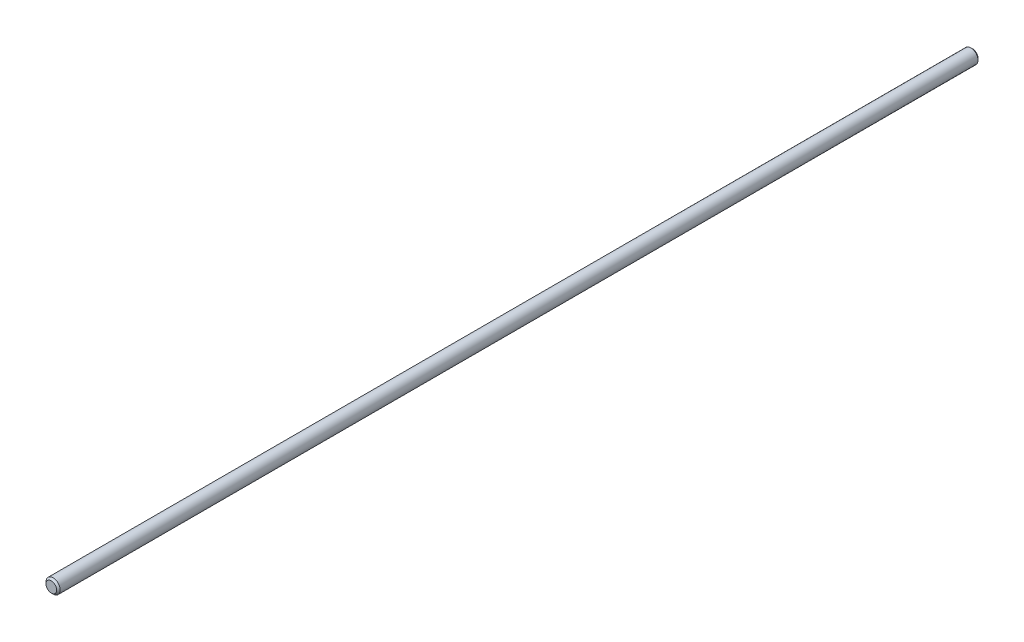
ISO-10303-21;
HEADER;
FILE_DESCRIPTION(('STEP AP214'),'2;1');
FILE_NAME('part.step','',(''),(''),'','','');
FILE_SCHEMA(('AUTOMOTIVE_DESIGN { 1 0 10303 214 1 1 1 1 }'));
ENDSEC;
DATA;
#1=APPLICATION_CONTEXT('core data for automotive mechanical design processes');
#2=APPLICATION_PROTOCOL_DEFINITION('international standard','automotive_design',2000,#1);
#3=PRODUCT_CONTEXT('',#1,'mechanical');
#4=PRODUCT('Part','Part','',(#3));
#5=PRODUCT_RELATED_PRODUCT_CATEGORY('part','',(#4));
#6=PRODUCT_DEFINITION_FORMATION('','',#4);
#7=PRODUCT_DEFINITION_CONTEXT('part definition',#1,'design');
#8=PRODUCT_DEFINITION('design','',#6,#7);
#9=PRODUCT_DEFINITION_SHAPE('','',#8);
#10=(LENGTH_UNIT() NAMED_UNIT(*) SI_UNIT(.MILLI.,.METRE.));
#11=(NAMED_UNIT(*) PLANE_ANGLE_UNIT() SI_UNIT($,.RADIAN.));
#12=(NAMED_UNIT(*) SI_UNIT($,.STERADIAN.) SOLID_ANGLE_UNIT());
#13=UNCERTAINTY_MEASURE_WITH_UNIT(LENGTH_MEASURE(1.E-05),#10,'distance_accuracy_value','');
#14=(GEOMETRIC_REPRESENTATION_CONTEXT(3) GLOBAL_UNCERTAINTY_ASSIGNED_CONTEXT((#13)) GLOBAL_UNIT_ASSIGNED_CONTEXT((#10,
#11,#12)) REPRESENTATION_CONTEXT('',''));
#15=CARTESIAN_POINT('',(0.,0.,0.));
#16=DIRECTION('',(0.,0.,1.));
#17=DIRECTION('',(1.,0.,0.));
#18=AXIS2_PLACEMENT_3D('',#15,#16,#17);
#19=CARTESIAN_POINT('',(0.,0.,-260.));
#20=DIRECTION('',(0.,0.,1.));
#21=DIRECTION('',(1.,0.,0.));
#22=AXIS2_PLACEMENT_3D('',#19,#20,#21);
#23=CYLINDRICAL_SURFACE('',#22,2.);
#24=CARTESIAN_POINT('',(0.,0.,-259.5));
#25=DIRECTION('',(0.,0.,1.));
#26=DIRECTION('',(1.,0.,0.));
#27=AXIS2_PLACEMENT_3D('',#24,#25,#26);
#28=CIRCLE('',#27,2.);
#29=CARTESIAN_POINT('',(2.,0.,-259.5));
#30=VERTEX_POINT('',#29);
#31=EDGE_CURVE('E43',#30,#30,#28,.T.);
#32=ORIENTED_EDGE('',*,*,#31,.T.);
#33=EDGE_LOOP('',(#32));
#34=FACE_BOUND('',#33,.T.);
#35=CARTESIAN_POINT('',(0.,0.,-0.5));
#36=DIRECTION('',(0.,0.,1.));
#37=DIRECTION('',(1.,0.,0.));
#38=AXIS2_PLACEMENT_3D('',#35,#36,#37);
#39=CIRCLE('',#38,2.);
#40=CARTESIAN_POINT('',(2.,0.,-0.5));
#41=VERTEX_POINT('',#40);
#42=EDGE_CURVE('E47',#41,#41,#39,.F.);
#43=ORIENTED_EDGE('',*,*,#42,.T.);
#44=EDGE_LOOP('',(#43));
#45=FACE_BOUND('',#44,.T.);
#46=ADVANCED_FACE('F32',(#34,#45),#23,.T.);
#47=CARTESIAN_POINT('',(0.,0.,-260.));
#48=DIRECTION('',(0.,0.,1.));
#49=DIRECTION('',(1.,0.,0.));
#50=AXIS2_PLACEMENT_3D('',#47,#48,#49);
#51=PLANE('',#50);
#52=CARTESIAN_POINT('',(0.,0.,-260.));
#53=DIRECTION('',(0.,0.,1.));
#54=DIRECTION('',(1.,0.,0.));
#55=AXIS2_PLACEMENT_3D('',#52,#53,#54);
#56=CIRCLE('',#55,1.50000000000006);
#57=CARTESIAN_POINT('',(1.50000000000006,0.,-260.));
#58=VERTEX_POINT('',#57);
#59=EDGE_CURVE('E39',#58,#58,#56,.F.);
#60=ORIENTED_EDGE('',*,*,#59,.T.);
#61=EDGE_LOOP('',(#60));
#62=FACE_BOUND('',#61,.T.);
#63=ADVANCED_FACE('F63',(#62),#51,.F.);
#64=CARTESIAN_POINT('',(0.,0.,0.));
#65=DIRECTION('',(0.,0.,1.));
#66=DIRECTION('',(1.,0.,0.));
#67=AXIS2_PLACEMENT_3D('',#64,#65,#66);
#68=PLANE('',#67);
#69=CARTESIAN_POINT('',(0.,0.,0.));
#70=DIRECTION('',(0.,0.,1.));
#71=DIRECTION('',(1.,0.,0.));
#72=AXIS2_PLACEMENT_3D('',#69,#70,#71);
#73=CIRCLE('',#72,1.5);
#74=CARTESIAN_POINT('',(1.5,0.,0.));
#75=VERTEX_POINT('',#74);
#76=EDGE_CURVE('E10',#75,#75,#73,.T.);
#77=ORIENTED_EDGE('',*,*,#76,.T.);
#78=EDGE_LOOP('',(#77));
#79=FACE_BOUND('',#78,.T.);
#80=ADVANCED_FACE('F60',(#79),#68,.T.);
#81=CARTESIAN_POINT('',(0.,0.,-259.5));
#82=DIRECTION('',(0.,0.,1.));
#83=DIRECTION('',(1.,0.,0.));
#84=AXIS2_PLACEMENT_3D('',#81,#82,#83);
#85=CONICAL_SURFACE('',#84,2.,0.785398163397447);
#86=ORIENTED_EDGE('',*,*,#59,.F.);
#87=EDGE_LOOP('',(#86));
#88=FACE_BOUND('',#87,.T.);
#89=ORIENTED_EDGE('',*,*,#31,.F.);
#90=EDGE_LOOP('',(#89));
#91=FACE_BOUND('',#90,.T.);
#92=ADVANCED_FACE('F56',(#88,#91),#85,.T.);
#93=CARTESIAN_POINT('',(0.,0.,0.));
#94=DIRECTION('',(0.,0.,-1.));
#95=DIRECTION('',(-1.,0.,0.));
#96=AXIS2_PLACEMENT_3D('',#93,#94,#95);
#97=CONICAL_SURFACE('',#96,1.5,0.785398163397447);
#98=ORIENTED_EDGE('',*,*,#42,.F.);
#99=EDGE_LOOP('',(#98));
#100=FACE_BOUND('',#99,.T.);
#101=ORIENTED_EDGE('',*,*,#76,.F.);
#102=EDGE_LOOP('',(#101));
#103=FACE_BOUND('',#102,.T.);
#104=ADVANCED_FACE('F34',(#100,#103),#97,.T.);
#105=CLOSED_SHELL('',(#46,#63,#80,#92,#104));
#106=MANIFOLD_SOLID_BREP('B2',#105);
#107=ADVANCED_BREP_SHAPE_REPRESENTATION('',(#18,#106),#14);
#108=SHAPE_DEFINITION_REPRESENTATION(#9,#107);
ENDSEC;
END-ISO-10303-21;
